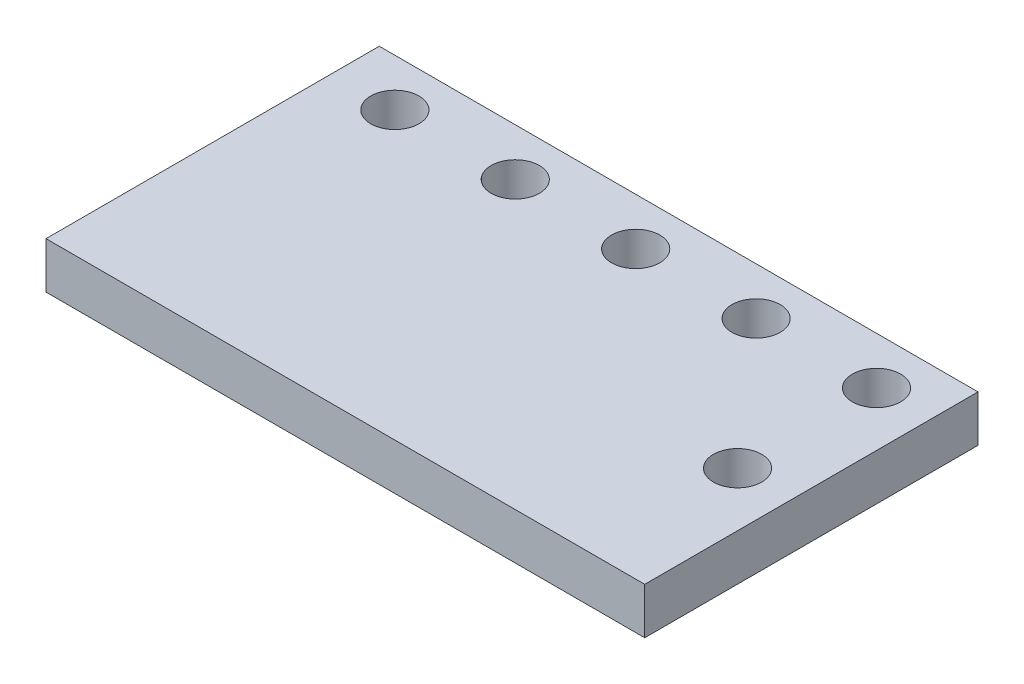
ISO-10303-21;
HEADER;
FILE_DESCRIPTION(('STEP AP214'),'2;1');
FILE_NAME('part.step','',(''),(''),'','','');
FILE_SCHEMA(('AUTOMOTIVE_DESIGN { 1 0 10303 214 1 1 1 1 }'));
ENDSEC;
DATA;
#1=APPLICATION_CONTEXT('core data for automotive mechanical design processes');
#2=APPLICATION_PROTOCOL_DEFINITION('international standard','automotive_design',2000,#1);
#3=PRODUCT_CONTEXT('',#1,'mechanical');
#4=PRODUCT('Part','Part','',(#3));
#5=PRODUCT_RELATED_PRODUCT_CATEGORY('part','',(#4));
#6=PRODUCT_DEFINITION_FORMATION('','',#4);
#7=PRODUCT_DEFINITION_CONTEXT('part definition',#1,'design');
#8=PRODUCT_DEFINITION('design','',#6,#7);
#9=PRODUCT_DEFINITION_SHAPE('','',#8);
#10=(LENGTH_UNIT() NAMED_UNIT(*) SI_UNIT(.MILLI.,.METRE.));
#11=(NAMED_UNIT(*) PLANE_ANGLE_UNIT() SI_UNIT($,.RADIAN.));
#12=(NAMED_UNIT(*) SI_UNIT($,.STERADIAN.) SOLID_ANGLE_UNIT());
#13=UNCERTAINTY_MEASURE_WITH_UNIT(LENGTH_MEASURE(1.E-05),#10,'distance_accuracy_value','');
#14=(GEOMETRIC_REPRESENTATION_CONTEXT(3) GLOBAL_UNCERTAINTY_ASSIGNED_CONTEXT((#13)) GLOBAL_UNIT_ASSIGNED_CONTEXT((#10,
#11,#12)) REPRESENTATION_CONTEXT('',''));
#15=CARTESIAN_POINT('',(0.,0.,0.));
#16=DIRECTION('',(0.,0.,1.));
#17=DIRECTION('',(1.,0.,0.));
#18=AXIS2_PLACEMENT_3D('',#15,#16,#17);
#19=CARTESIAN_POINT('',(-82.0898951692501,12.7,-45.6953603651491));
#20=DIRECTION('',(1.,0.,0.));
#21=DIRECTION('',(0.,0.,-1.));
#22=AXIS2_PLACEMENT_3D('',#19,#20,#21);
#23=PLANE('',#22);
#24=DIRECTION('',(0.,0.,1.));
#25=VECTOR('',#24,1.);
#26=CARTESIAN_POINT('',(-82.0898951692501,0.,-45.6953603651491));
#27=LINE('',#26,#25);
#28=CARTESIAN_POINT('',(-82.0898951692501,0.,-45.6953603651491));
#29=VERTEX_POINT('',#28);
#30=CARTESIAN_POINT('',(-82.0898951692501,0.,45.6953603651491));
#31=VERTEX_POINT('',#30);
#32=EDGE_CURVE('E74',#29,#31,#27,.T.);
#33=ORIENTED_EDGE('',*,*,#32,.T.);
#34=DIRECTION('',(0.,-1.,0.));
#35=VECTOR('',#34,1.);
#36=CARTESIAN_POINT('',(-82.0898951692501,12.7,45.6953603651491));
#37=LINE('',#36,#35);
#38=CARTESIAN_POINT('',(-82.0898951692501,12.7,45.6953603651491));
#39=VERTEX_POINT('',#38);
#40=EDGE_CURVE('E81',#39,#31,#37,.T.);
#41=ORIENTED_EDGE('',*,*,#40,.F.);
#42=DIRECTION('',(0.,0.,1.));
#43=VECTOR('',#42,1.);
#44=CARTESIAN_POINT('',(-82.0898951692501,12.7,-45.6953603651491));
#45=LINE('',#44,#43);
#46=CARTESIAN_POINT('',(-82.0898951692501,12.7,-45.6953603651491));
#47=VERTEX_POINT('',#46);
#48=EDGE_CURVE('E101',#47,#39,#45,.T.);
#49=ORIENTED_EDGE('',*,*,#48,.F.);
#50=DIRECTION('',(0.,-1.,0.));
#51=VECTOR('',#50,1.);
#52=CARTESIAN_POINT('',(-82.0898951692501,12.7,-45.6953603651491));
#53=LINE('',#52,#51);
#54=EDGE_CURVE('E90',#47,#29,#53,.T.);
#55=ORIENTED_EDGE('',*,*,#54,.T.);
#56=EDGE_LOOP('',(#33,#41,#49,#55));
#57=FACE_BOUND('',#56,.T.);
#58=ADVANCED_FACE('F27',(#57),#23,.F.);
#59=CARTESIAN_POINT('',(-82.0898951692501,12.7,45.6953603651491));
#60=DIRECTION('',(0.,0.,-1.));
#61=DIRECTION('',(-1.,0.,0.));
#62=AXIS2_PLACEMENT_3D('',#59,#60,#61);
#63=PLANE('',#62);
#64=DIRECTION('',(1.,0.,0.));
#65=VECTOR('',#64,1.);
#66=CARTESIAN_POINT('',(-82.0898951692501,0.,45.6953603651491));
#67=LINE('',#66,#65);
#68=CARTESIAN_POINT('',(82.0898951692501,0.,45.6953603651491));
#69=VERTEX_POINT('',#68);
#70=EDGE_CURVE('E68',#31,#69,#67,.T.);
#71=ORIENTED_EDGE('',*,*,#70,.T.);
#72=DIRECTION('',(0.,-1.,0.));
#73=VECTOR('',#72,1.);
#74=CARTESIAN_POINT('',(82.0898951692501,12.7,45.6953603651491));
#75=LINE('',#74,#73);
#76=CARTESIAN_POINT('',(82.0898951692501,12.7,45.6953603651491));
#77=VERTEX_POINT('',#76);
#78=EDGE_CURVE('E87',#77,#69,#75,.T.);
#79=ORIENTED_EDGE('',*,*,#78,.F.);
#80=DIRECTION('',(1.,0.,0.));
#81=VECTOR('',#80,1.);
#82=CARTESIAN_POINT('',(-82.0898951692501,12.7,45.6953603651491));
#83=LINE('',#82,#81);
#84=EDGE_CURVE('E83',#39,#77,#83,.T.);
#85=ORIENTED_EDGE('',*,*,#84,.F.);
#86=ORIENTED_EDGE('',*,*,#40,.T.);
#87=EDGE_LOOP('',(#71,#79,#85,#86));
#88=FACE_BOUND('',#87,.T.);
#89=ADVANCED_FACE('F82',(#88),#63,.F.);
#90=CARTESIAN_POINT('',(82.0898951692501,12.7,-45.6953603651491));
#91=DIRECTION('',(-1.,0.,0.));
#92=DIRECTION('',(0.,0.,1.));
#93=AXIS2_PLACEMENT_3D('',#90,#91,#92);
#94=PLANE('',#93);
#95=DIRECTION('',(0.,0.,-1.));
#96=VECTOR('',#95,1.);
#97=CARTESIAN_POINT('',(82.0898951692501,0.,-45.6953603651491));
#98=LINE('',#97,#96);
#99=CARTESIAN_POINT('',(82.0898951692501,0.,-45.6953603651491));
#100=VERTEX_POINT('',#99);
#101=EDGE_CURVE('E75',#69,#100,#98,.T.);
#102=ORIENTED_EDGE('',*,*,#101,.T.);
#103=DIRECTION('',(0.,-1.,0.));
#104=VECTOR('',#103,1.);
#105=CARTESIAN_POINT('',(82.0898951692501,12.7,-45.6953603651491));
#106=LINE('',#105,#104);
#107=CARTESIAN_POINT('',(82.0898951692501,12.7,-45.6953603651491));
#108=VERTEX_POINT('',#107);
#109=EDGE_CURVE('E107',#108,#100,#106,.T.);
#110=ORIENTED_EDGE('',*,*,#109,.F.);
#111=DIRECTION('',(0.,0.,-1.));
#112=VECTOR('',#111,1.);
#113=CARTESIAN_POINT('',(82.0898951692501,12.7,-45.6953603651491));
#114=LINE('',#113,#112);
#115=EDGE_CURVE('E47',#77,#108,#114,.T.);
#116=ORIENTED_EDGE('',*,*,#115,.F.);
#117=ORIENTED_EDGE('',*,*,#78,.T.);
#118=EDGE_LOOP('',(#102,#110,#116,#117));
#119=FACE_BOUND('',#118,.T.);
#120=ADVANCED_FACE('F149',(#119),#94,.F.);
#121=CARTESIAN_POINT('',(-82.0898951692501,12.7,-45.6953603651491));
#122=DIRECTION('',(0.,0.,1.));
#123=DIRECTION('',(1.,0.,0.));
#124=AXIS2_PLACEMENT_3D('',#121,#122,#123);
#125=PLANE('',#124);
#126=DIRECTION('',(-1.,0.,0.));
#127=VECTOR('',#126,1.);
#128=CARTESIAN_POINT('',(-82.0898951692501,0.,-45.6953603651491));
#129=LINE('',#128,#127);
#130=EDGE_CURVE('E99',#100,#29,#129,.T.);
#131=ORIENTED_EDGE('',*,*,#130,.T.);
#132=ORIENTED_EDGE('',*,*,#54,.F.);
#133=DIRECTION('',(-1.,0.,0.));
#134=VECTOR('',#133,1.);
#135=CARTESIAN_POINT('',(-82.0898951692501,12.7,-45.6953603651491));
#136=LINE('',#135,#134);
#137=EDGE_CURVE('E42',#108,#47,#136,.T.);
#138=ORIENTED_EDGE('',*,*,#137,.F.);
#139=ORIENTED_EDGE('',*,*,#109,.T.);
#140=EDGE_LOOP('',(#131,#132,#138,#139));
#141=FACE_BOUND('',#140,.T.);
#142=ADVANCED_FACE('F138',(#141),#125,.F.);
#143=CARTESIAN_POINT('',(-82.0898951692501,12.7,45.6953603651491));
#144=DIRECTION('',(0.,1.,0.));
#145=DIRECTION('',(0.,0.,1.));
#146=AXIS2_PLACEMENT_3D('',#143,#144,#145);
#147=PLANE('',#146);
#148=CARTESIAN_POINT('',(34.2269841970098,12.7,-32.7092581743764));
#149=DIRECTION('',(0.,1.,0.));
#150=DIRECTION('',(0.,0.,1.));
#151=AXIS2_PLACEMENT_3D('',#148,#149,#150);
#152=CIRCLE('',#151,6.61451112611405);
#153=CARTESIAN_POINT('',(34.2269841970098,12.7,-26.0947470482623));
#154=VERTEX_POINT('',#153);
#155=EDGE_CURVE('E238',#154,#154,#152,.T.);
#156=ORIENTED_EDGE('',*,*,#155,.F.);
#157=EDGE_LOOP('',(#156));
#158=FACE_BOUND('',#157,.T.);
#159=CARTESIAN_POINT('',(67.2469841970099,12.7,-32.7092581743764));
#160=DIRECTION('',(0.,1.,0.));
#161=DIRECTION('',(0.,0.,1.));
#162=AXIS2_PLACEMENT_3D('',#159,#160,#161);
#163=CIRCLE('',#162,6.61451112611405);
#164=CARTESIAN_POINT('',(67.2469841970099,12.7,-26.0947470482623));
#165=VERTEX_POINT('',#164);
#166=EDGE_CURVE('E94',#165,#165,#163,.T.);
#167=ORIENTED_EDGE('',*,*,#166,.F.);
#168=EDGE_LOOP('',(#167));
#169=FACE_BOUND('',#168,.T.);
#170=ORIENTED_EDGE('',*,*,#48,.T.);
#171=ORIENTED_EDGE('',*,*,#84,.T.);
#172=ORIENTED_EDGE('',*,*,#115,.T.);
#173=ORIENTED_EDGE('',*,*,#137,.T.);
#174=EDGE_LOOP('',(#170,#171,#172,#173));
#175=FACE_BOUND('',#174,.T.);
#176=CARTESIAN_POINT('',(1.20698419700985,12.7,-32.7092581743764));
#177=DIRECTION('',(0.,1.,0.));
#178=DIRECTION('',(0.,0.,1.));
#179=AXIS2_PLACEMENT_3D('',#176,#177,#178);
#180=CIRCLE('',#179,6.61451112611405);
#181=CARTESIAN_POINT('',(1.20698419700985,12.7,-26.0947470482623));
#182=VERTEX_POINT('',#181);
#183=EDGE_CURVE('E113',#182,#182,#180,.T.);
#184=ORIENTED_EDGE('',*,*,#183,.F.);
#185=EDGE_LOOP('',(#184));
#186=FACE_BOUND('',#185,.T.);
#187=CARTESIAN_POINT('',(-31.8130158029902,12.7,-32.7092581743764));
#188=DIRECTION('',(0.,1.,0.));
#189=DIRECTION('',(0.,0.,1.));
#190=AXIS2_PLACEMENT_3D('',#187,#188,#189);
#191=CIRCLE('',#190,6.61451112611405);
#192=CARTESIAN_POINT('',(-31.8130158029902,12.7,-26.0947470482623));
#193=VERTEX_POINT('',#192);
#194=EDGE_CURVE('E119',#193,#193,#191,.T.);
#195=ORIENTED_EDGE('',*,*,#194,.F.);
#196=EDGE_LOOP('',(#195));
#197=FACE_BOUND('',#196,.T.);
#198=CARTESIAN_POINT('',(-64.8330158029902,12.7,-32.7092581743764));
#199=DIRECTION('',(0.,1.,0.));
#200=DIRECTION('',(0.,0.,1.));
#201=AXIS2_PLACEMENT_3D('',#198,#199,#200);
#202=CIRCLE('',#201,6.61451112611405);
#203=CARTESIAN_POINT('',(-64.8330158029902,12.7,-26.0947470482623));
#204=VERTEX_POINT('',#203);
#205=EDGE_CURVE('E125',#204,#204,#202,.T.);
#206=ORIENTED_EDGE('',*,*,#205,.F.);
#207=EDGE_LOOP('',(#206));
#208=FACE_BOUND('',#207,.T.);
#209=CARTESIAN_POINT('',(67.2469841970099,12.7,5.39074182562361));
#210=DIRECTION('',(0.,1.,0.));
#211=DIRECTION('',(0.,0.,1.));
#212=AXIS2_PLACEMENT_3D('',#209,#210,#211);
#213=CIRCLE('',#212,6.61451112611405);
#214=CARTESIAN_POINT('',(67.2469841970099,12.7,12.0052529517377));
#215=VERTEX_POINT('',#214);
#216=EDGE_CURVE('E11',#215,#215,#213,.T.);
#217=ORIENTED_EDGE('',*,*,#216,.F.);
#218=EDGE_LOOP('',(#217));
#219=FACE_BOUND('',#218,.T.);
#220=ADVANCED_FACE('F136',(#158,#169,#175,#186,#197,#208,#219),#147,.T.);
#221=CARTESIAN_POINT('',(-82.0898951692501,0.,45.6953603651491));
#222=DIRECTION('',(0.,1.,0.));
#223=DIRECTION('',(0.,0.,1.));
#224=AXIS2_PLACEMENT_3D('',#221,#222,#223);
#225=PLANE('',#224);
#226=CARTESIAN_POINT('',(34.2269841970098,0.,-32.7092581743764));
#227=DIRECTION('',(0.,1.,0.));
#228=DIRECTION('',(0.,0.,1.));
#229=AXIS2_PLACEMENT_3D('',#226,#227,#228);
#230=CIRCLE('',#229,6.61451112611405);
#231=CARTESIAN_POINT('',(34.2269841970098,0.,-26.0947470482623));
#232=VERTEX_POINT('',#231);
#233=EDGE_CURVE('E240',#232,#232,#230,.T.);
#234=ORIENTED_EDGE('',*,*,#233,.T.);
#235=EDGE_LOOP('',(#234));
#236=FACE_BOUND('',#235,.T.);
#237=CARTESIAN_POINT('',(67.2469841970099,0.,-32.7092581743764));
#238=DIRECTION('',(0.,1.,0.));
#239=DIRECTION('',(0.,0.,1.));
#240=AXIS2_PLACEMENT_3D('',#237,#238,#239);
#241=CIRCLE('',#240,6.61451112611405);
#242=CARTESIAN_POINT('',(67.2469841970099,0.,-26.0947470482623));
#243=VERTEX_POINT('',#242);
#244=EDGE_CURVE('E91',#243,#243,#241,.T.);
#245=ORIENTED_EDGE('',*,*,#244,.T.);
#246=EDGE_LOOP('',(#245));
#247=FACE_BOUND('',#246,.T.);
#248=ORIENTED_EDGE('',*,*,#32,.F.);
#249=ORIENTED_EDGE('',*,*,#130,.F.);
#250=ORIENTED_EDGE('',*,*,#101,.F.);
#251=ORIENTED_EDGE('',*,*,#70,.F.);
#252=EDGE_LOOP('',(#248,#249,#250,#251));
#253=FACE_BOUND('',#252,.T.);
#254=CARTESIAN_POINT('',(1.20698419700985,0.,-32.7092581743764));
#255=DIRECTION('',(0.,1.,0.));
#256=DIRECTION('',(0.,0.,1.));
#257=AXIS2_PLACEMENT_3D('',#254,#255,#256);
#258=CIRCLE('',#257,6.61451112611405);
#259=CARTESIAN_POINT('',(1.20698419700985,0.,-26.0947470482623));
#260=VERTEX_POINT('',#259);
#261=EDGE_CURVE('E86',#260,#260,#258,.T.);
#262=ORIENTED_EDGE('',*,*,#261,.T.);
#263=EDGE_LOOP('',(#262));
#264=FACE_BOUND('',#263,.T.);
#265=CARTESIAN_POINT('',(-31.8130158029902,0.,-32.7092581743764));
#266=DIRECTION('',(0.,1.,0.));
#267=DIRECTION('',(0.,0.,1.));
#268=AXIS2_PLACEMENT_3D('',#265,#266,#267);
#269=CIRCLE('',#268,6.61451112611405);
#270=CARTESIAN_POINT('',(-31.8130158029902,0.,-26.0947470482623));
#271=VERTEX_POINT('',#270);
#272=EDGE_CURVE('E116',#271,#271,#269,.T.);
#273=ORIENTED_EDGE('',*,*,#272,.T.);
#274=EDGE_LOOP('',(#273));
#275=FACE_BOUND('',#274,.T.);
#276=CARTESIAN_POINT('',(-64.8330158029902,0.,-32.7092581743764));
#277=DIRECTION('',(0.,1.,0.));
#278=DIRECTION('',(0.,0.,1.));
#279=AXIS2_PLACEMENT_3D('',#276,#277,#278);
#280=CIRCLE('',#279,6.61451112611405);
#281=CARTESIAN_POINT('',(-64.8330158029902,0.,-26.0947470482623));
#282=VERTEX_POINT('',#281);
#283=EDGE_CURVE('E122',#282,#282,#280,.T.);
#284=ORIENTED_EDGE('',*,*,#283,.T.);
#285=EDGE_LOOP('',(#284));
#286=FACE_BOUND('',#285,.T.);
#287=CARTESIAN_POINT('',(67.2469841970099,0.,5.39074182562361));
#288=DIRECTION('',(0.,1.,0.));
#289=DIRECTION('',(0.,0.,1.));
#290=AXIS2_PLACEMENT_3D('',#287,#288,#289);
#291=CIRCLE('',#290,6.61451112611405);
#292=CARTESIAN_POINT('',(67.2469841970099,0.,12.0052529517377));
#293=VERTEX_POINT('',#292);
#294=EDGE_CURVE('E35',#293,#293,#291,.T.);
#295=ORIENTED_EDGE('',*,*,#294,.T.);
#296=EDGE_LOOP('',(#295));
#297=FACE_BOUND('',#296,.T.);
#298=ADVANCED_FACE('F70',(#236,#247,#253,#264,#275,#286,#297),#225,.F.);
#299=CARTESIAN_POINT('',(67.2469841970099,0.,-32.7092581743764));
#300=DIRECTION('',(0.,1.,0.));
#301=DIRECTION('',(0.,0.,1.));
#302=AXIS2_PLACEMENT_3D('',#299,#300,#301);
#303=CYLINDRICAL_SURFACE('',#302,6.61451112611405);
#304=ORIENTED_EDGE('',*,*,#244,.F.);
#305=EDGE_LOOP('',(#304));
#306=FACE_BOUND('',#305,.T.);
#307=ORIENTED_EDGE('',*,*,#166,.T.);
#308=EDGE_LOOP('',(#307));
#309=FACE_BOUND('',#308,.T.);
#310=ADVANCED_FACE('F145',(#306,#309),#303,.F.);
#311=CARTESIAN_POINT('',(34.2269841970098,0.,-32.7092581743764));
#312=DIRECTION('',(0.,1.,0.));
#313=DIRECTION('',(0.,0.,1.));
#314=AXIS2_PLACEMENT_3D('',#311,#312,#313);
#315=CYLINDRICAL_SURFACE('',#314,6.61451112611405);
#316=ORIENTED_EDGE('',*,*,#233,.F.);
#317=EDGE_LOOP('',(#316));
#318=FACE_BOUND('',#317,.T.);
#319=ORIENTED_EDGE('',*,*,#155,.T.);
#320=EDGE_LOOP('',(#319));
#321=FACE_BOUND('',#320,.T.);
#322=ADVANCED_FACE('F166',(#318,#321),#315,.F.);
#323=CARTESIAN_POINT('',(1.20698419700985,0.,-32.7092581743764));
#324=DIRECTION('',(0.,1.,0.));
#325=DIRECTION('',(0.,0.,1.));
#326=AXIS2_PLACEMENT_3D('',#323,#324,#325);
#327=CYLINDRICAL_SURFACE('',#326,6.61451112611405);
#328=ORIENTED_EDGE('',*,*,#261,.F.);
#329=EDGE_LOOP('',(#328));
#330=FACE_BOUND('',#329,.T.);
#331=ORIENTED_EDGE('',*,*,#183,.T.);
#332=EDGE_LOOP('',(#331));
#333=FACE_BOUND('',#332,.T.);
#334=ADVANCED_FACE('F162',(#330,#333),#327,.F.);
#335=CARTESIAN_POINT('',(-31.8130158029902,0.,-32.7092581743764));
#336=DIRECTION('',(0.,1.,0.));
#337=DIRECTION('',(0.,0.,1.));
#338=AXIS2_PLACEMENT_3D('',#335,#336,#337);
#339=CYLINDRICAL_SURFACE('',#338,6.61451112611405);
#340=ORIENTED_EDGE('',*,*,#272,.F.);
#341=EDGE_LOOP('',(#340));
#342=FACE_BOUND('',#341,.T.);
#343=ORIENTED_EDGE('',*,*,#194,.T.);
#344=EDGE_LOOP('',(#343));
#345=FACE_BOUND('',#344,.T.);
#346=ADVANCED_FACE('F165',(#342,#345),#339,.F.);
#347=CARTESIAN_POINT('',(-64.8330158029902,0.,-32.7092581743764));
#348=DIRECTION('',(0.,1.,0.));
#349=DIRECTION('',(0.,0.,1.));
#350=AXIS2_PLACEMENT_3D('',#347,#348,#349);
#351=CYLINDRICAL_SURFACE('',#350,6.61451112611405);
#352=ORIENTED_EDGE('',*,*,#283,.F.);
#353=EDGE_LOOP('',(#352));
#354=FACE_BOUND('',#353,.T.);
#355=ORIENTED_EDGE('',*,*,#205,.T.);
#356=EDGE_LOOP('',(#355));
#357=FACE_BOUND('',#356,.T.);
#358=ADVANCED_FACE('F133',(#354,#357),#351,.F.);
#359=CARTESIAN_POINT('',(67.2469841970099,0.,5.39074182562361));
#360=DIRECTION('',(0.,1.,0.));
#361=DIRECTION('',(0.,0.,1.));
#362=AXIS2_PLACEMENT_3D('',#359,#360,#361);
#363=CYLINDRICAL_SURFACE('',#362,6.61451112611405);
#364=ORIENTED_EDGE('',*,*,#294,.F.);
#365=EDGE_LOOP('',(#364));
#366=FACE_BOUND('',#365,.T.);
#367=ORIENTED_EDGE('',*,*,#216,.T.);
#368=EDGE_LOOP('',(#367));
#369=FACE_BOUND('',#368,.T.);
#370=ADVANCED_FACE('F29',(#366,#369),#363,.F.);
#371=CLOSED_SHELL('',(#58,#89,#120,#142,#220,#298,#310,#322,#334,#346,#358,#370));
#372=MANIFOLD_SOLID_BREP('B2',#371);
#373=ADVANCED_BREP_SHAPE_REPRESENTATION('',(#18,#372),#14);
#374=SHAPE_DEFINITION_REPRESENTATION(#9,#373);
ENDSEC;
END-ISO-10303-21;
